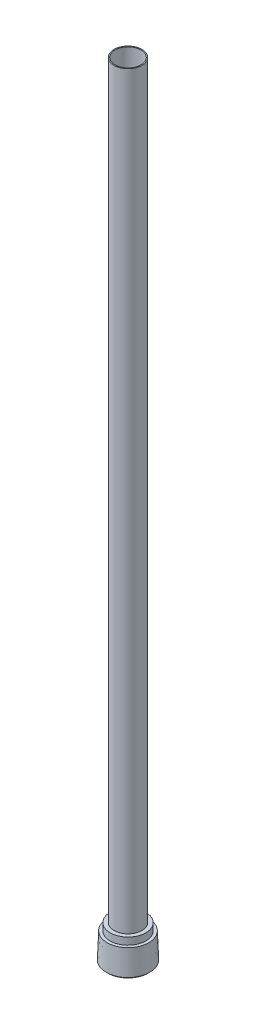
ISO-10303-21;
HEADER;
FILE_DESCRIPTION(('STEP AP214'),'2;1');
FILE_NAME('part.step','',(''),(''),'','','');
FILE_SCHEMA(('AUTOMOTIVE_DESIGN { 1 0 10303 214 1 1 1 1 }'));
ENDSEC;
DATA;
#1=APPLICATION_CONTEXT('core data for automotive mechanical design processes');
#2=APPLICATION_PROTOCOL_DEFINITION('international standard','automotive_design',2000,#1);
#3=PRODUCT_CONTEXT('',#1,'mechanical');
#4=PRODUCT('Part','Part','',(#3));
#5=PRODUCT_RELATED_PRODUCT_CATEGORY('part','',(#4));
#6=PRODUCT_DEFINITION_FORMATION('','',#4);
#7=PRODUCT_DEFINITION_CONTEXT('part definition',#1,'design');
#8=PRODUCT_DEFINITION('design','',#6,#7);
#9=PRODUCT_DEFINITION_SHAPE('','',#8);
#10=(LENGTH_UNIT() NAMED_UNIT(*) SI_UNIT(.MILLI.,.METRE.));
#11=(NAMED_UNIT(*) PLANE_ANGLE_UNIT() SI_UNIT($,.RADIAN.));
#12=(NAMED_UNIT(*) SI_UNIT($,.STERADIAN.) SOLID_ANGLE_UNIT());
#13=UNCERTAINTY_MEASURE_WITH_UNIT(LENGTH_MEASURE(1.E-05),#10,'distance_accuracy_value','');
#14=(GEOMETRIC_REPRESENTATION_CONTEXT(3) GLOBAL_UNCERTAINTY_ASSIGNED_CONTEXT((#13)) GLOBAL_UNIT_ASSIGNED_CONTEXT((#10,
#11,#12)) REPRESENTATION_CONTEXT('',''));
#15=CARTESIAN_POINT('',(0.,0.,0.));
#16=DIRECTION('',(0.,0.,1.));
#17=DIRECTION('',(1.,0.,0.));
#18=AXIS2_PLACEMENT_3D('',#15,#16,#17);
#19=CARTESIAN_POINT('',(0.,0.,0.));
#20=DIRECTION('',(0.,1.,0.));
#21=DIRECTION('',(0.,0.,1.));
#22=AXIS2_PLACEMENT_3D('',#19,#20,#21);
#23=PLANE('',#22);
#24=CARTESIAN_POINT('',(0.,0.,0.));
#25=DIRECTION('',(0.,1.,0.));
#26=DIRECTION('',(0.,0.,1.));
#27=AXIS2_PLACEMENT_3D('',#24,#25,#26);
#28=CIRCLE('',#27,7.96289999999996);
#29=CARTESIAN_POINT('',(0.,0.,7.96289999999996));
#30=VERTEX_POINT('',#29);
#31=EDGE_CURVE('E11',#30,#30,#28,.F.);
#32=ORIENTED_EDGE('',*,*,#31,.T.);
#33=EDGE_LOOP('',(#32));
#34=FACE_BOUND('',#33,.T.);
#35=DIRECTION('',(-0.866025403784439,0.,-0.5));
#36=VECTOR('',#35,1.);
#37=CARTESIAN_POINT('',(0.,0.,4.57538541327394));
#38=LINE('',#37,#36);
#39=CARTESIAN_POINT('',(0.,0.,4.57538541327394));
#40=VERTEX_POINT('',#39);
#41=CARTESIAN_POINT('',(-3.9624,0.,2.28769270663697));
#42=VERTEX_POINT('',#41);
#43=EDGE_CURVE('E210',#40,#42,#38,.T.);
#44=ORIENTED_EDGE('',*,*,#43,.F.);
#45=DIRECTION('',(-0.866025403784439,0.,0.5));
#46=VECTOR('',#45,1.);
#47=CARTESIAN_POINT('',(3.9624,0.,2.28769270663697));
#48=LINE('',#47,#46);
#49=CARTESIAN_POINT('',(3.9624,0.,2.28769270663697));
#50=VERTEX_POINT('',#49);
#51=EDGE_CURVE('E50',#50,#40,#48,.T.);
#52=ORIENTED_EDGE('',*,*,#51,.F.);
#53=DIRECTION('',(0.,0.,1.));
#54=VECTOR('',#53,1.);
#55=CARTESIAN_POINT('',(3.9624,0.,-2.28769270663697));
#56=LINE('',#55,#54);
#57=CARTESIAN_POINT('',(3.9624,0.,-2.28769270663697));
#58=VERTEX_POINT('',#57);
#59=EDGE_CURVE('E84',#58,#50,#56,.T.);
#60=ORIENTED_EDGE('',*,*,#59,.F.);
#61=DIRECTION('',(0.866025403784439,0.,0.5));
#62=VECTOR('',#61,1.);
#63=CARTESIAN_POINT('',(0.,0.,-4.57538541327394));
#64=LINE('',#63,#62);
#65=CARTESIAN_POINT('',(0.,0.,-4.57538541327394));
#66=VERTEX_POINT('',#65);
#67=EDGE_CURVE('E93',#66,#58,#64,.T.);
#68=ORIENTED_EDGE('',*,*,#67,.F.);
#69=DIRECTION('',(0.866025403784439,0.,-0.5));
#70=VECTOR('',#69,1.);
#71=CARTESIAN_POINT('',(-3.9624,0.,-2.28769270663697));
#72=LINE('',#71,#70);
#73=CARTESIAN_POINT('',(-3.9624,0.,-2.28769270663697));
#74=VERTEX_POINT('',#73);
#75=EDGE_CURVE('E99',#74,#66,#72,.T.);
#76=ORIENTED_EDGE('',*,*,#75,.F.);
#77=DIRECTION('',(0.,0.,-1.));
#78=VECTOR('',#77,1.);
#79=CARTESIAN_POINT('',(-3.9624,0.,2.28769270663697));
#80=LINE('',#79,#78);
#81=EDGE_CURVE('E224',#42,#74,#80,.T.);
#82=ORIENTED_EDGE('',*,*,#81,.F.);
#83=EDGE_LOOP('',(#44,#52,#60,#68,#76,#82));
#84=FACE_BOUND('',#83,.T.);
#85=ADVANCED_FACE('F34',(#34,#84),#23,.F.);
#86=CARTESIAN_POINT('',(0.,0.,0.));
#87=DIRECTION('',(0.,-1.,0.));
#88=DIRECTION('',(0.,0.,-1.));
#89=AXIS2_PLACEMENT_3D('',#86,#87,#88);
#90=CONICAL_SURFACE('',#89,8.4709,0.0364424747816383);
#91=CARTESIAN_POINT('',(0.,0.49013051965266,0.));
#92=DIRECTION('',(0.,1.,0.));
#93=DIRECTION('',(0.,0.,1.));
#94=AXIS2_PLACEMENT_3D('',#91,#92,#93);
#95=CIRCLE('',#94,8.45303051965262);
#96=CARTESIAN_POINT('',(0.,0.490130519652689,8.45303051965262));
#97=VERTEX_POINT('',#96);
#98=EDGE_CURVE('E43',#97,#97,#95,.T.);
#99=ORIENTED_EDGE('',*,*,#98,.T.);
#100=EDGE_LOOP('',(#99));
#101=FACE_BOUND('',#100,.T.);
#102=CARTESIAN_POINT('',(0.,10.3124,0.));
#103=DIRECTION('',(0.,1.,0.));
#104=DIRECTION('',(0.,0.,1.));
#105=AXIS2_PLACEMENT_3D('',#102,#103,#104);
#106=CIRCLE('',#105,8.09492416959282);
#107=CARTESIAN_POINT('',(0.,10.3124000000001,8.09492416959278));
#108=VERTEX_POINT('',#107);
#109=EDGE_CURVE('E127',#108,#108,#106,.T.);
#110=ORIENTED_EDGE('',*,*,#109,.F.);
#111=EDGE_LOOP('',(#110));
#112=FACE_BOUND('',#111,.T.);
#113=ADVANCED_FACE('F132',(#101,#112),#90,.T.);
#114=CARTESIAN_POINT('',(0.,10.3124,-8.09492416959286));
#115=DIRECTION('',(0.,-1.,0.));
#116=DIRECTION('',(0.,0.,-1.));
#117=AXIS2_PLACEMENT_3D('',#114,#115,#116);
#118=PLANE('',#117);
#119=CARTESIAN_POINT('',(0.,10.3124,0.));
#120=DIRECTION('',(0.,1.,0.));
#121=DIRECTION('',(0.,0.,1.));
#122=AXIS2_PLACEMENT_3D('',#119,#120,#121);
#123=CIRCLE('',#122,6.93419999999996);
#124=CARTESIAN_POINT('',(0.,10.3124000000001,6.93419999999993));
#125=VERTEX_POINT('',#124);
#126=EDGE_CURVE('E124',#125,#125,#123,.T.);
#127=ORIENTED_EDGE('',*,*,#126,.F.);
#128=EDGE_LOOP('',(#127));
#129=FACE_BOUND('',#128,.T.);
#130=ORIENTED_EDGE('',*,*,#109,.T.);
#131=EDGE_LOOP('',(#130));
#132=FACE_BOUND('',#131,.T.);
#133=ADVANCED_FACE('F150',(#129,#132),#118,.F.);
#134=CARTESIAN_POINT('',(0.,0.,0.));
#135=DIRECTION('',(0.,1.,0.));
#136=DIRECTION('',(0.,0.,1.));
#137=AXIS2_PLACEMENT_3D('',#134,#135,#136);
#138=CYLINDRICAL_SURFACE('',#137,6.93419999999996);
#139=CARTESIAN_POINT('',(0.,13.081,0.));
#140=DIRECTION('',(0.,1.,0.));
#141=DIRECTION('',(0.,0.,1.));
#142=AXIS2_PLACEMENT_3D('',#139,#140,#141);
#143=CIRCLE('',#142,6.93419999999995);
#144=CARTESIAN_POINT('',(0.,13.0810000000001,6.93419999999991));
#145=VERTEX_POINT('',#144);
#146=EDGE_CURVE('E121',#145,#145,#143,.T.);
#147=ORIENTED_EDGE('',*,*,#146,.F.);
#148=EDGE_LOOP('',(#147));
#149=FACE_BOUND('',#148,.T.);
#150=ORIENTED_EDGE('',*,*,#126,.T.);
#151=EDGE_LOOP('',(#150));
#152=FACE_BOUND('',#151,.T.);
#153=ADVANCED_FACE('F155',(#149,#152),#138,.T.);
#154=CARTESIAN_POINT('',(0.,13.081,-6.9342));
#155=DIRECTION('',(0.,-1.,0.));
#156=DIRECTION('',(0.,0.,-1.));
#157=AXIS2_PLACEMENT_3D('',#154,#155,#156);
#158=PLANE('',#157);
#159=CARTESIAN_POINT('',(0.,13.081,0.));
#160=DIRECTION('',(0.,1.,0.));
#161=DIRECTION('',(0.,0.,1.));
#162=AXIS2_PLACEMENT_3D('',#159,#160,#161);
#163=CIRCLE('',#162,5.42289999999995);
#164=CARTESIAN_POINT('',(0.,13.081,5.42289999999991));
#165=VERTEX_POINT('',#164);
#166=EDGE_CURVE('E118',#165,#165,#163,.T.);
#167=ORIENTED_EDGE('',*,*,#166,.F.);
#168=EDGE_LOOP('',(#167));
#169=FACE_BOUND('',#168,.T.);
#170=ORIENTED_EDGE('',*,*,#146,.T.);
#171=EDGE_LOOP('',(#170));
#172=FACE_BOUND('',#171,.T.);
#173=ADVANCED_FACE('F159',(#169,#172),#158,.F.);
#174=CARTESIAN_POINT('',(0.,0.,0.));
#175=DIRECTION('',(0.,1.,0.));
#176=DIRECTION('',(0.,0.,1.));
#177=AXIS2_PLACEMENT_3D('',#174,#175,#176);
#178=CYLINDRICAL_SURFACE('',#177,5.42289999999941);
#179=CARTESIAN_POINT('',(0.,304.8,-1.06420362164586E-12));
#180=DIRECTION('',(0.,1.,0.));
#181=DIRECTION('',(0.,0.,1.));
#182=AXIS2_PLACEMENT_3D('',#179,#180,#181);
#183=CIRCLE('',#182,5.42289999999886);
#184=CARTESIAN_POINT('',(0.,304.8,5.4228999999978));
#185=VERTEX_POINT('',#184);
#186=EDGE_CURVE('E107',#185,#185,#183,.T.);
#187=ORIENTED_EDGE('',*,*,#186,.F.);
#188=EDGE_LOOP('',(#187));
#189=FACE_BOUND('',#188,.T.);
#190=ORIENTED_EDGE('',*,*,#166,.T.);
#191=EDGE_LOOP('',(#190));
#192=FACE_BOUND('',#191,.T.);
#193=ADVANCED_FACE('F163',(#189,#192),#178,.T.);
#194=CARTESIAN_POINT('',(0.,304.8,-5.42289999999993));
#195=DIRECTION('',(0.,-1.,0.));
#196=DIRECTION('',(0.,0.,-1.));
#197=AXIS2_PLACEMENT_3D('',#194,#195,#196);
#198=PLANE('',#197);
#199=CARTESIAN_POINT('',(0.,304.8,-1.06420362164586E-12));
#200=DIRECTION('',(0.,1.,0.));
#201=DIRECTION('',(0.,0.,1.));
#202=AXIS2_PLACEMENT_3D('',#199,#200,#201);
#203=CIRCLE('',#202,5.0419);
#204=CARTESIAN_POINT('',(0.,304.8,5.04189999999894));
#205=VERTEX_POINT('',#204);
#206=EDGE_CURVE('E228',#205,#205,#203,.T.);
#207=ORIENTED_EDGE('',*,*,#206,.F.);
#208=EDGE_LOOP('',(#207));
#209=FACE_BOUND('',#208,.T.);
#210=ORIENTED_EDGE('',*,*,#186,.T.);
#211=EDGE_LOOP('',(#210));
#212=FACE_BOUND('',#211,.T.);
#213=ADVANCED_FACE('F167',(#209,#212),#198,.F.);
#214=CARTESIAN_POINT('',(3.9624,7.92480000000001,2.28769270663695));
#215=DIRECTION('',(0.5,0.,0.866025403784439));
#216=DIRECTION('',(0.866025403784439,0.,-0.5));
#217=AXIS2_PLACEMENT_3D('',#214,#215,#216);
#218=PLANE('',#217);
#219=ORIENTED_EDGE('',*,*,#51,.T.);
#220=DIRECTION('',(0.,-1.,0.));
#221=VECTOR('',#220,1.);
#222=CARTESIAN_POINT('',(0.,7.92480000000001,4.57538541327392));
#223=LINE('',#222,#221);
#224=CARTESIAN_POINT('',(0.,7.92480000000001,4.57538541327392));
#225=VERTEX_POINT('',#224);
#226=EDGE_CURVE('E114',#225,#40,#223,.T.);
#227=ORIENTED_EDGE('',*,*,#226,.F.);
#228=DIRECTION('',(-0.866025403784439,0.,0.5));
#229=VECTOR('',#228,1.);
#230=CARTESIAN_POINT('',(3.9624,7.92480000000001,2.28769270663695));
#231=LINE('',#230,#229);
#232=CARTESIAN_POINT('',(3.9624,7.92480000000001,2.28769270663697));
#233=VERTEX_POINT('',#232);
#234=EDGE_CURVE('E59',#233,#225,#231,.T.);
#235=ORIENTED_EDGE('',*,*,#234,.F.);
#236=DIRECTION('',(0.,-1.,0.));
#237=VECTOR('',#236,1.);
#238=CARTESIAN_POINT('',(3.9624,7.92480000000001,2.28769270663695));
#239=LINE('',#238,#237);
#240=EDGE_CURVE('E89',#233,#50,#239,.T.);
#241=ORIENTED_EDGE('',*,*,#240,.T.);
#242=EDGE_LOOP('',(#219,#227,#235,#241));
#243=FACE_BOUND('',#242,.T.);
#244=ADVANCED_FACE('F171',(#243),#218,.F.);
#245=CARTESIAN_POINT('',(3.9624,7.92479999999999,-2.287692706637));
#246=DIRECTION('',(1.,0.,0.));
#247=DIRECTION('',(0.,0.,-1.));
#248=AXIS2_PLACEMENT_3D('',#245,#246,#247);
#249=PLANE('',#248);
#250=ORIENTED_EDGE('',*,*,#59,.T.);
#251=ORIENTED_EDGE('',*,*,#240,.F.);
#252=DIRECTION('',(0.,0.,1.));
#253=VECTOR('',#252,1.);
#254=CARTESIAN_POINT('',(3.9624,7.92479999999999,-2.287692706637));
#255=LINE('',#254,#253);
#256=CARTESIAN_POINT('',(3.9624,7.92479999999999,-2.287692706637));
#257=VERTEX_POINT('',#256);
#258=EDGE_CURVE('E86',#257,#233,#255,.T.);
#259=ORIENTED_EDGE('',*,*,#258,.F.);
#260=DIRECTION('',(0.,-1.,0.));
#261=VECTOR('',#260,1.);
#262=CARTESIAN_POINT('',(3.9624,7.92479999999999,-2.287692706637));
#263=LINE('',#262,#261);
#264=EDGE_CURVE('E79',#257,#58,#263,.T.);
#265=ORIENTED_EDGE('',*,*,#264,.T.);
#266=EDGE_LOOP('',(#250,#251,#259,#265));
#267=FACE_BOUND('',#266,.T.);
#268=ADVANCED_FACE('F81',(#267),#249,.F.);
#269=CARTESIAN_POINT('',(0.,7.92479999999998,-4.57538541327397));
#270=DIRECTION('',(0.5,0.,-0.866025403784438));
#271=DIRECTION('',(-0.866025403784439,0.,-0.5));
#272=AXIS2_PLACEMENT_3D('',#269,#270,#271);
#273=PLANE('',#272);
#274=ORIENTED_EDGE('',*,*,#67,.T.);
#275=ORIENTED_EDGE('',*,*,#264,.F.);
#276=DIRECTION('',(0.866025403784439,0.,0.5));
#277=VECTOR('',#276,1.);
#278=CARTESIAN_POINT('',(0.,7.92479999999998,-4.57538541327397));
#279=LINE('',#278,#277);
#280=CARTESIAN_POINT('',(0.,7.92479999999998,-4.57538541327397));
#281=VERTEX_POINT('',#280);
#282=EDGE_CURVE('E216',#281,#257,#279,.T.);
#283=ORIENTED_EDGE('',*,*,#282,.F.);
#284=DIRECTION('',(0.,-1.,0.));
#285=VECTOR('',#284,1.);
#286=CARTESIAN_POINT('',(0.,7.92479999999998,-4.57538541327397));
#287=LINE('',#286,#285);
#288=EDGE_CURVE('E90',#281,#66,#287,.T.);
#289=ORIENTED_EDGE('',*,*,#288,.T.);
#290=EDGE_LOOP('',(#274,#275,#283,#289));
#291=FACE_BOUND('',#290,.T.);
#292=ADVANCED_FACE('F94',(#291),#273,.F.);
#293=CARTESIAN_POINT('',(-3.9624,7.92479999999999,-2.287692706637));
#294=DIRECTION('',(-0.5,0.,-0.866025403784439));
#295=DIRECTION('',(-0.866025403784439,0.,0.5));
#296=AXIS2_PLACEMENT_3D('',#293,#294,#295);
#297=PLANE('',#296);
#298=ORIENTED_EDGE('',*,*,#75,.T.);
#299=ORIENTED_EDGE('',*,*,#288,.F.);
#300=DIRECTION('',(0.866025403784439,0.,-0.5));
#301=VECTOR('',#300,1.);
#302=CARTESIAN_POINT('',(-3.9624,7.92479999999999,-2.287692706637));
#303=LINE('',#302,#301);
#304=CARTESIAN_POINT('',(-3.9624,7.92479999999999,-2.287692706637));
#305=VERTEX_POINT('',#304);
#306=EDGE_CURVE('E214',#305,#281,#303,.T.);
#307=ORIENTED_EDGE('',*,*,#306,.F.);
#308=DIRECTION('',(0.,-1.,0.));
#309=VECTOR('',#308,1.);
#310=CARTESIAN_POINT('',(-3.9624,7.92479999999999,-2.287692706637));
#311=LINE('',#310,#309);
#312=EDGE_CURVE('E110',#305,#74,#311,.T.);
#313=ORIENTED_EDGE('',*,*,#312,.T.);
#314=EDGE_LOOP('',(#298,#299,#307,#313));
#315=FACE_BOUND('',#314,.T.);
#316=ADVANCED_FACE('F182',(#315),#297,.F.);
#317=CARTESIAN_POINT('',(-3.9624,7.92480000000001,2.28769270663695));
#318=DIRECTION('',(-1.,0.,0.));
#319=DIRECTION('',(0.,0.,1.));
#320=AXIS2_PLACEMENT_3D('',#317,#318,#319);
#321=PLANE('',#320);
#322=ORIENTED_EDGE('',*,*,#81,.T.);
#323=ORIENTED_EDGE('',*,*,#312,.F.);
#324=DIRECTION('',(0.,0.,-1.));
#325=VECTOR('',#324,1.);
#326=CARTESIAN_POINT('',(-3.9624,7.92480000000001,2.28769270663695));
#327=LINE('',#326,#325);
#328=CARTESIAN_POINT('',(-3.9624,7.92480000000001,2.28769270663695));
#329=VERTEX_POINT('',#328);
#330=EDGE_CURVE('E205',#329,#305,#327,.T.);
#331=ORIENTED_EDGE('',*,*,#330,.F.);
#332=DIRECTION('',(0.,-1.,0.));
#333=VECTOR('',#332,1.);
#334=CARTESIAN_POINT('',(-3.9624,7.92480000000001,2.28769270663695));
#335=LINE('',#334,#333);
#336=EDGE_CURVE('E112',#329,#42,#335,.T.);
#337=ORIENTED_EDGE('',*,*,#336,.T.);
#338=EDGE_LOOP('',(#322,#323,#331,#337));
#339=FACE_BOUND('',#338,.T.);
#340=ADVANCED_FACE('F178',(#339),#321,.F.);
#341=CARTESIAN_POINT('',(0.,7.92480000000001,4.57538541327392));
#342=DIRECTION('',(-0.5,0.,0.866025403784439));
#343=DIRECTION('',(0.866025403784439,0.,0.5));
#344=AXIS2_PLACEMENT_3D('',#341,#342,#343);
#345=PLANE('',#344);
#346=ORIENTED_EDGE('',*,*,#43,.T.);
#347=ORIENTED_EDGE('',*,*,#336,.F.);
#348=DIRECTION('',(-0.866025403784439,0.,-0.5));
#349=VECTOR('',#348,1.);
#350=CARTESIAN_POINT('',(0.,7.92480000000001,4.57538541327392));
#351=LINE('',#350,#349);
#352=EDGE_CURVE('E103',#225,#329,#351,.T.);
#353=ORIENTED_EDGE('',*,*,#352,.F.);
#354=ORIENTED_EDGE('',*,*,#226,.T.);
#355=EDGE_LOOP('',(#346,#347,#353,#354));
#356=FACE_BOUND('',#355,.T.);
#357=ADVANCED_FACE('F175',(#356),#345,.F.);
#358=CARTESIAN_POINT('',(0.,7.92480000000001,4.57538541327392));
#359=DIRECTION('',(0.,-1.,0.));
#360=DIRECTION('',(0.,0.,-1.));
#361=AXIS2_PLACEMENT_3D('',#358,#359,#360);
#362=PLANE('',#361);
#363=CARTESIAN_POINT('',(0.,7.9248,0.));
#364=DIRECTION('',(0.,-1.,0.));
#365=DIRECTION('',(0.,0.,-1.));
#366=AXIS2_PLACEMENT_3D('',#363,#364,#365);
#367=CIRCLE('',#366,5.0419);
#368=CARTESIAN_POINT('',(0.,7.92479999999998,-5.04190000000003));
#369=VERTEX_POINT('',#368);
#370=EDGE_CURVE('E197',#369,#369,#367,.F.);
#371=ORIENTED_EDGE('',*,*,#370,.T.);
#372=EDGE_LOOP('',(#371));
#373=FACE_BOUND('',#372,.T.);
#374=ORIENTED_EDGE('',*,*,#352,.T.);
#375=ORIENTED_EDGE('',*,*,#330,.T.);
#376=ORIENTED_EDGE('',*,*,#306,.T.);
#377=ORIENTED_EDGE('',*,*,#282,.T.);
#378=ORIENTED_EDGE('',*,*,#258,.T.);
#379=ORIENTED_EDGE('',*,*,#234,.T.);
#380=EDGE_LOOP('',(#374,#375,#376,#377,#378,#379));
#381=FACE_BOUND('',#380,.T.);
#382=ADVANCED_FACE('F141',(#373,#381),#362,.F.);
#383=CARTESIAN_POINT('',(0.,-6.33584672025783,0.));
#384=DIRECTION('',(0.,1.,0.));
#385=DIRECTION('',(0.,0.,1.));
#386=AXIS2_PLACEMENT_3D('',#383,#384,#385);
#387=CYLINDRICAL_SURFACE('',#386,5.0419);
#388=ORIENTED_EDGE('',*,*,#206,.T.);
#389=EDGE_LOOP('',(#388));
#390=FACE_BOUND('',#389,.T.);
#391=ORIENTED_EDGE('',*,*,#370,.F.);
#392=EDGE_LOOP('',(#391));
#393=FACE_BOUND('',#392,.T.);
#394=ADVANCED_FACE('F136',(#390,#393),#387,.F.);
#395=CARTESIAN_POINT('',(0.,0.490130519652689,0.));
#396=DIRECTION('',(0.,1.,0.));
#397=DIRECTION('',(0.,0.,1.));
#398=AXIS2_PLACEMENT_3D('',#395,#396,#397);
#399=CONICAL_SURFACE('',#398,8.45303051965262,0.785398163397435);
#400=ORIENTED_EDGE('',*,*,#31,.F.);
#401=EDGE_LOOP('',(#400));
#402=FACE_BOUND('',#401,.T.);
#403=ORIENTED_EDGE('',*,*,#98,.F.);
#404=EDGE_LOOP('',(#403));
#405=FACE_BOUND('',#404,.T.);
#406=ADVANCED_FACE('F37',(#402,#405),#399,.T.);
#407=CLOSED_SHELL('',(#85,#113,#133,#153,#173,#193,#213,#244,#268,#292,#316,#340,#357,#382,#394,#406));
#408=MANIFOLD_SOLID_BREP('B2',#407);
#409=ADVANCED_BREP_SHAPE_REPRESENTATION('',(#18,#408),#14);
#410=SHAPE_DEFINITION_REPRESENTATION(#9,#409);
ENDSEC;
END-ISO-10303-21;
